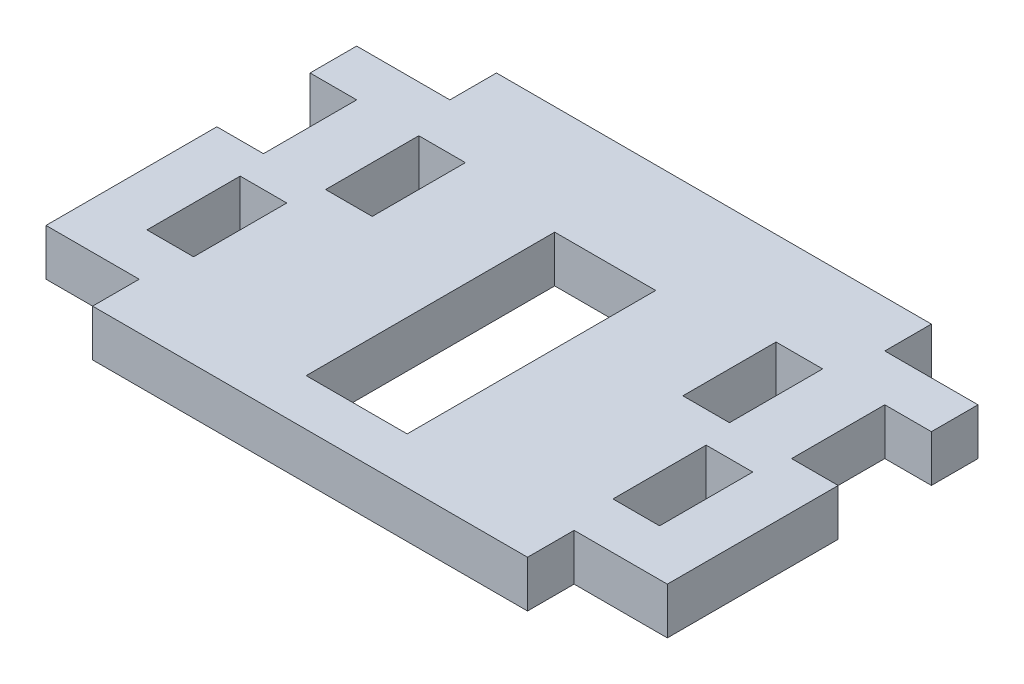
ISO-10303-21;
HEADER;
FILE_DESCRIPTION(('STEP AP214'),'2;1');
FILE_NAME('part.step','',(''),(''),'','','');
FILE_SCHEMA(('AUTOMOTIVE_DESIGN { 1 0 10303 214 1 1 1 1 }'));
ENDSEC;
DATA;
#1=APPLICATION_CONTEXT('core data for automotive mechanical design processes');
#2=APPLICATION_PROTOCOL_DEFINITION('international standard','automotive_design',2000,#1);
#3=PRODUCT_CONTEXT('',#1,'mechanical');
#4=PRODUCT('Part','Part','',(#3));
#5=PRODUCT_RELATED_PRODUCT_CATEGORY('part','',(#4));
#6=PRODUCT_DEFINITION_FORMATION('','',#4);
#7=PRODUCT_DEFINITION_CONTEXT('part definition',#1,'design');
#8=PRODUCT_DEFINITION('design','',#6,#7);
#9=PRODUCT_DEFINITION_SHAPE('','',#8);
#10=(LENGTH_UNIT() NAMED_UNIT(*) SI_UNIT(.MILLI.,.METRE.));
#11=(NAMED_UNIT(*) PLANE_ANGLE_UNIT() SI_UNIT($,.RADIAN.));
#12=(NAMED_UNIT(*) SI_UNIT($,.STERADIAN.) SOLID_ANGLE_UNIT());
#13=UNCERTAINTY_MEASURE_WITH_UNIT(LENGTH_MEASURE(1.E-05),#10,'distance_accuracy_value','');
#14=(GEOMETRIC_REPRESENTATION_CONTEXT(3) GLOBAL_UNCERTAINTY_ASSIGNED_CONTEXT((#13)) GLOBAL_UNIT_ASSIGNED_CONTEXT((#10,
#11,#12)) REPRESENTATION_CONTEXT('',''));
#15=CARTESIAN_POINT('',(0.,0.,0.));
#16=DIRECTION('',(0.,0.,1.));
#17=DIRECTION('',(1.,0.,0.));
#18=AXIS2_PLACEMENT_3D('',#15,#16,#17);
#19=CARTESIAN_POINT('',(20.,3.,10.));
#20=DIRECTION('',(0.,1.,0.));
#21=DIRECTION('',(0.,0.,1.));
#22=AXIS2_PLACEMENT_3D('',#19,#20,#21);
#23=PLANE('',#22);
#24=DIRECTION('',(-1.,0.,0.));
#25=VECTOR('',#24,1.);
#26=CARTESIAN_POINT('',(13.,3.,-7.));
#27=LINE('',#26,#25);
#28=CARTESIAN_POINT('',(13.,3.,-7.));
#29=VERTEX_POINT('',#28);
#30=CARTESIAN_POINT('',(10.,3.,-7.));
#31=VERTEX_POINT('',#30);
#32=EDGE_CURVE('E329',#29,#31,#27,.T.);
#33=ORIENTED_EDGE('',*,*,#32,.F.);
#34=DIRECTION('',(0.,0.,-1.));
#35=VECTOR('',#34,1.);
#36=CARTESIAN_POINT('',(13.,3.,-7.));
#37=LINE('',#36,#35);
#38=CARTESIAN_POINT('',(13.,3.,-0.999999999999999));
#39=VERTEX_POINT('',#38);
#40=EDGE_CURVE('E327',#39,#29,#37,.T.);
#41=ORIENTED_EDGE('',*,*,#40,.F.);
#42=DIRECTION('',(1.,0.,0.));
#43=VECTOR('',#42,1.);
#44=CARTESIAN_POINT('',(13.,3.,-0.999999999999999));
#45=LINE('',#44,#43);
#46=CARTESIAN_POINT('',(10.,3.,-0.999999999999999));
#47=VERTEX_POINT('',#46);
#48=EDGE_CURVE('E335',#47,#39,#45,.T.);
#49=ORIENTED_EDGE('',*,*,#48,.F.);
#50=DIRECTION('',(0.,0.,1.));
#51=VECTOR('',#50,1.);
#52=CARTESIAN_POINT('',(10.,3.,-7.));
#53=LINE('',#52,#51);
#54=EDGE_CURVE('E332',#31,#47,#53,.T.);
#55=ORIENTED_EDGE('',*,*,#54,.F.);
#56=EDGE_LOOP('',(#33,#41,#49,#55));
#57=FACE_BOUND('',#56,.T.);
#58=DIRECTION('',(1.,0.,0.));
#59=VECTOR('',#58,1.);
#60=CARTESIAN_POINT('',(-16.5,3.,7.));
#61=LINE('',#60,#59);
#62=CARTESIAN_POINT('',(-16.5,3.,7.));
#63=VERTEX_POINT('',#62);
#64=CARTESIAN_POINT('',(-13.5,3.,7.));
#65=VERTEX_POINT('',#64);
#66=EDGE_CURVE('E384',#63,#65,#61,.T.);
#67=ORIENTED_EDGE('',*,*,#66,.F.);
#68=DIRECTION('',(0.,0.,1.));
#69=VECTOR('',#68,1.);
#70=CARTESIAN_POINT('',(-16.5,3.,1.));
#71=LINE('',#70,#69);
#72=CARTESIAN_POINT('',(-16.5,3.,1.));
#73=VERTEX_POINT('',#72);
#74=EDGE_CURVE('E382',#73,#63,#71,.T.);
#75=ORIENTED_EDGE('',*,*,#74,.F.);
#76=DIRECTION('',(-1.,0.,0.));
#77=VECTOR('',#76,1.);
#78=CARTESIAN_POINT('',(-16.5,3.,1.));
#79=LINE('',#78,#77);
#80=CARTESIAN_POINT('',(-13.5,3.,1.));
#81=VERTEX_POINT('',#80);
#82=EDGE_CURVE('E390',#81,#73,#79,.T.);
#83=ORIENTED_EDGE('',*,*,#82,.F.);
#84=DIRECTION('',(0.,0.,-1.));
#85=VECTOR('',#84,1.);
#86=CARTESIAN_POINT('',(-13.5,3.,1.));
#87=LINE('',#86,#85);
#88=EDGE_CURVE('E387',#65,#81,#87,.T.);
#89=ORIENTED_EDGE('',*,*,#88,.F.);
#90=EDGE_LOOP('',(#67,#75,#83,#89));
#91=FACE_BOUND('',#90,.T.);
#92=DIRECTION('',(-1.,0.,0.));
#93=VECTOR('',#92,1.);
#94=CARTESIAN_POINT('',(-3.25,3.,-6.));
#95=LINE('',#94,#93);
#96=CARTESIAN_POINT('',(3.25,3.,-6.));
#97=VERTEX_POINT('',#96);
#98=CARTESIAN_POINT('',(-3.25,3.,-6.));
#99=VERTEX_POINT('',#98);
#100=EDGE_CURVE('E470',#97,#99,#95,.T.);
#101=ORIENTED_EDGE('',*,*,#100,.F.);
#102=DIRECTION('',(0.,0.,-1.));
#103=VECTOR('',#102,1.);
#104=CARTESIAN_POINT('',(3.25,3.,6.));
#105=LINE('',#104,#103);
#106=CARTESIAN_POINT('',(3.25,3.,10.));
#107=VERTEX_POINT('',#106);
#108=EDGE_CURVE('E468',#107,#97,#105,.T.);
#109=ORIENTED_EDGE('',*,*,#108,.F.);
#110=DIRECTION('',(1.,0.,0.));
#111=VECTOR('',#110,1.);
#112=CARTESIAN_POINT('',(-3.25,3.,10.));
#113=LINE('',#112,#111);
#114=CARTESIAN_POINT('',(-3.25,3.,10.));
#115=VERTEX_POINT('',#114);
#116=EDGE_CURVE('E476',#115,#107,#113,.T.);
#117=ORIENTED_EDGE('',*,*,#116,.F.);
#118=DIRECTION('',(0.,0.,1.));
#119=VECTOR('',#118,1.);
#120=CARTESIAN_POINT('',(-3.25,3.,-6.));
#121=LINE('',#120,#119);
#122=EDGE_CURVE('E473',#99,#115,#121,.T.);
#123=ORIENTED_EDGE('',*,*,#122,.F.);
#124=EDGE_LOOP('',(#101,#109,#117,#123));
#125=FACE_BOUND('',#124,.T.);
#126=DIRECTION('',(1.,0.,0.));
#127=VECTOR('',#126,1.);
#128=CARTESIAN_POINT('',(-13.,3.,-0.999999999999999));
#129=LINE('',#128,#127);
#130=CARTESIAN_POINT('',(-13.,3.,-0.999999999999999));
#131=VERTEX_POINT('',#130);
#132=CARTESIAN_POINT('',(-10.,3.,-0.999999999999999));
#133=VERTEX_POINT('',#132);
#134=EDGE_CURVE('E415',#131,#133,#129,.T.);
#135=ORIENTED_EDGE('',*,*,#134,.F.);
#136=DIRECTION('',(0.,0.,1.));
#137=VECTOR('',#136,1.);
#138=CARTESIAN_POINT('',(-13.,3.,-7.));
#139=LINE('',#138,#137);
#140=CARTESIAN_POINT('',(-13.,3.,-7.));
#141=VERTEX_POINT('',#140);
#142=EDGE_CURVE('E413',#141,#131,#139,.T.);
#143=ORIENTED_EDGE('',*,*,#142,.F.);
#144=DIRECTION('',(-1.,0.,0.));
#145=VECTOR('',#144,1.);
#146=CARTESIAN_POINT('',(-13.,3.,-7.));
#147=LINE('',#146,#145);
#148=CARTESIAN_POINT('',(-10.,3.,-7.));
#149=VERTEX_POINT('',#148);
#150=EDGE_CURVE('E421',#149,#141,#147,.T.);
#151=ORIENTED_EDGE('',*,*,#150,.F.);
#152=DIRECTION('',(0.,0.,-1.));
#153=VECTOR('',#152,1.);
#154=CARTESIAN_POINT('',(-10.,3.,-7.));
#155=LINE('',#154,#153);
#156=EDGE_CURVE('E418',#133,#149,#155,.T.);
#157=ORIENTED_EDGE('',*,*,#156,.F.);
#158=EDGE_LOOP('',(#135,#143,#151,#157));
#159=FACE_BOUND('',#158,.T.);
#160=DIRECTION('',(0.,0.,-1.));
#161=VECTOR('',#160,1.);
#162=CARTESIAN_POINT('',(20.,3.,-10.));
#163=LINE('',#162,#161);
#164=CARTESIAN_POINT('',(20.,3.,10.));
#165=VERTEX_POINT('',#164);
#166=CARTESIAN_POINT('',(20.,3.,-0.999999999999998));
#167=VERTEX_POINT('',#166);
#168=EDGE_CURVE('E600',#165,#167,#163,.T.);
#169=ORIENTED_EDGE('',*,*,#168,.T.);
#170=DIRECTION('',(1.,0.,0.));
#171=VECTOR('',#170,1.);
#172=CARTESIAN_POINT('',(20.,3.,-0.999999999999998));
#173=LINE('',#172,#171);
#174=CARTESIAN_POINT('',(17.,3.,-0.999999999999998));
#175=VERTEX_POINT('',#174);
#176=EDGE_CURVE('E358',#175,#167,#173,.T.);
#177=ORIENTED_EDGE('',*,*,#176,.F.);
#178=DIRECTION('',(0.,0.,1.));
#179=VECTOR('',#178,1.);
#180=CARTESIAN_POINT('',(17.,3.,-7.));
#181=LINE('',#180,#179);
#182=CARTESIAN_POINT('',(17.,3.,-7.));
#183=VERTEX_POINT('',#182);
#184=EDGE_CURVE('E363',#183,#175,#181,.T.);
#185=ORIENTED_EDGE('',*,*,#184,.F.);
#186=DIRECTION('',(-1.,0.,0.));
#187=VECTOR('',#186,1.);
#188=CARTESIAN_POINT('',(20.,3.,-7.));
#189=LINE('',#188,#187);
#190=CARTESIAN_POINT('',(20.,3.,-7.));
#191=VERTEX_POINT('',#190);
#192=EDGE_CURVE('E360',#191,#183,#189,.T.);
#193=ORIENTED_EDGE('',*,*,#192,.F.);
#194=CARTESIAN_POINT('',(20.,3.,-10.));
#195=VERTEX_POINT('',#194);
#196=EDGE_CURVE('E617',#191,#195,#163,.T.);
#197=ORIENTED_EDGE('',*,*,#196,.T.);
#198=DIRECTION('',(-1.,0.,0.));
#199=VECTOR('',#198,1.);
#200=CARTESIAN_POINT('',(-20.,3.,-10.));
#201=LINE('',#200,#199);
#202=CARTESIAN_POINT('',(14.,3.,-10.));
#203=VERTEX_POINT('',#202);
#204=EDGE_CURVE('E562',#195,#203,#201,.T.);
#205=ORIENTED_EDGE('',*,*,#204,.T.);
#206=DIRECTION('',(0.,0.,-1.));
#207=VECTOR('',#206,1.);
#208=CARTESIAN_POINT('',(14.,3.,-13.));
#209=LINE('',#208,#207);
#210=CARTESIAN_POINT('',(14.,3.,-13.));
#211=VERTEX_POINT('',#210);
#212=EDGE_CURVE('E706',#203,#211,#209,.T.);
#213=ORIENTED_EDGE('',*,*,#212,.T.);
#214=DIRECTION('',(-1.,0.,0.));
#215=VECTOR('',#214,1.);
#216=CARTESIAN_POINT('',(14.,3.,-13.));
#217=LINE('',#216,#215);
#218=CARTESIAN_POINT('',(-14.,3.,-13.));
#219=VERTEX_POINT('',#218);
#220=EDGE_CURVE('E702',#211,#219,#217,.T.);
#221=ORIENTED_EDGE('',*,*,#220,.T.);
#222=DIRECTION('',(0.,0.,1.));
#223=VECTOR('',#222,1.);
#224=CARTESIAN_POINT('',(-14.,3.,-13.));
#225=LINE('',#224,#223);
#226=CARTESIAN_POINT('',(-14.,3.,-10.));
#227=VERTEX_POINT('',#226);
#228=EDGE_CURVE('E611',#219,#227,#225,.T.);
#229=ORIENTED_EDGE('',*,*,#228,.T.);
#230=CARTESIAN_POINT('',(-20.,3.,-10.));
#231=VERTEX_POINT('',#230);
#232=EDGE_CURVE('E598',#227,#231,#201,.T.);
#233=ORIENTED_EDGE('',*,*,#232,.T.);
#234=DIRECTION('',(0.,0.,1.));
#235=VECTOR('',#234,1.);
#236=CARTESIAN_POINT('',(-20.,3.,-10.));
#237=LINE('',#236,#235);
#238=CARTESIAN_POINT('',(-20.,3.,-7.));
#239=VERTEX_POINT('',#238);
#240=EDGE_CURVE('E555',#231,#239,#237,.T.);
#241=ORIENTED_EDGE('',*,*,#240,.T.);
#242=DIRECTION('',(-1.,0.,0.));
#243=VECTOR('',#242,1.);
#244=CARTESIAN_POINT('',(-20.,3.,-7.));
#245=LINE('',#244,#243);
#246=CARTESIAN_POINT('',(-17.,3.,-7.));
#247=VERTEX_POINT('',#246);
#248=EDGE_CURVE('E449',#247,#239,#245,.T.);
#249=ORIENTED_EDGE('',*,*,#248,.F.);
#250=DIRECTION('',(0.,0.,-1.));
#251=VECTOR('',#250,1.);
#252=CARTESIAN_POINT('',(-17.,3.,-7.));
#253=LINE('',#252,#251);
#254=CARTESIAN_POINT('',(-17.,3.,-0.999999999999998));
#255=VERTEX_POINT('',#254);
#256=EDGE_CURVE('E446',#255,#247,#253,.T.);
#257=ORIENTED_EDGE('',*,*,#256,.F.);
#258=DIRECTION('',(1.,0.,0.));
#259=VECTOR('',#258,1.);
#260=CARTESIAN_POINT('',(-20.,3.,-0.999999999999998));
#261=LINE('',#260,#259);
#262=CARTESIAN_POINT('',(-20.,3.,-0.999999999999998));
#263=VERTEX_POINT('',#262);
#264=EDGE_CURVE('E444',#263,#255,#261,.T.);
#265=ORIENTED_EDGE('',*,*,#264,.F.);
#266=CARTESIAN_POINT('',(-20.,3.,10.));
#267=VERTEX_POINT('',#266);
#268=EDGE_CURVE('E558',#263,#267,#237,.T.);
#269=ORIENTED_EDGE('',*,*,#268,.T.);
#270=DIRECTION('',(1.,0.,0.));
#271=VECTOR('',#270,1.);
#272=CARTESIAN_POINT('',(-20.,3.,10.));
#273=LINE('',#272,#271);
#274=CARTESIAN_POINT('',(-14.,3.,10.));
#275=VERTEX_POINT('',#274);
#276=EDGE_CURVE('E554',#267,#275,#273,.T.);
#277=ORIENTED_EDGE('',*,*,#276,.T.);
#278=DIRECTION('',(0.,0.,1.));
#279=VECTOR('',#278,1.);
#280=CARTESIAN_POINT('',(-14.,3.,13.));
#281=LINE('',#280,#279);
#282=CARTESIAN_POINT('',(-14.,3.,13.));
#283=VERTEX_POINT('',#282);
#284=EDGE_CURVE('E501',#275,#283,#281,.T.);
#285=ORIENTED_EDGE('',*,*,#284,.T.);
#286=DIRECTION('',(1.,0.,0.));
#287=VECTOR('',#286,1.);
#288=CARTESIAN_POINT('',(14.,3.,13.));
#289=LINE('',#288,#287);
#290=CARTESIAN_POINT('',(14.,3.,13.));
#291=VERTEX_POINT('',#290);
#292=EDGE_CURVE('E498',#283,#291,#289,.T.);
#293=ORIENTED_EDGE('',*,*,#292,.T.);
#294=DIRECTION('',(0.,0.,-1.));
#295=VECTOR('',#294,1.);
#296=CARTESIAN_POINT('',(14.,3.,13.));
#297=LINE('',#296,#295);
#298=CARTESIAN_POINT('',(14.,3.,10.));
#299=VERTEX_POINT('',#298);
#300=EDGE_CURVE('E504',#291,#299,#297,.T.);
#301=ORIENTED_EDGE('',*,*,#300,.T.);
#302=EDGE_CURVE('E534',#299,#165,#273,.T.);
#303=ORIENTED_EDGE('',*,*,#302,.T.);
#304=EDGE_LOOP('',(#169,#177,#185,#193,#197,#205,#213,#221,#229,#233,#241,#249,#257,#265,#269,
#277,#285,#293,#301,#303));
#305=FACE_BOUND('',#304,.T.);
#306=DIRECTION('',(0.,0.,1.));
#307=VECTOR('',#306,1.);
#308=CARTESIAN_POINT('',(13.5,3.,1.));
#309=LINE('',#308,#307);
#310=CARTESIAN_POINT('',(13.5,3.,1.));
#311=VERTEX_POINT('',#310);
#312=CARTESIAN_POINT('',(13.5,3.,7.));
#313=VERTEX_POINT('',#312);
#314=EDGE_CURVE('E299',#311,#313,#309,.T.);
#315=ORIENTED_EDGE('',*,*,#314,.F.);
#316=DIRECTION('',(-1.,0.,0.));
#317=VECTOR('',#316,1.);
#318=CARTESIAN_POINT('',(16.5,3.,1.));
#319=LINE('',#318,#317);
#320=CARTESIAN_POINT('',(16.5,3.,1.));
#321=VERTEX_POINT('',#320);
#322=EDGE_CURVE('E291',#321,#311,#319,.T.);
#323=ORIENTED_EDGE('',*,*,#322,.F.);
#324=DIRECTION('',(0.,0.,-1.));
#325=VECTOR('',#324,1.);
#326=CARTESIAN_POINT('',(16.5,3.,1.));
#327=LINE('',#326,#325);
#328=CARTESIAN_POINT('',(16.5,3.,7.));
#329=VERTEX_POINT('',#328);
#330=EDGE_CURVE('E313',#329,#321,#327,.T.);
#331=ORIENTED_EDGE('',*,*,#330,.F.);
#332=DIRECTION('',(1.,0.,0.));
#333=VECTOR('',#332,1.);
#334=CARTESIAN_POINT('',(16.5,3.,7.));
#335=LINE('',#334,#333);
#336=EDGE_CURVE('E311',#313,#329,#335,.T.);
#337=ORIENTED_EDGE('',*,*,#336,.F.);
#338=EDGE_LOOP('',(#315,#323,#331,#337));
#339=FACE_BOUND('',#338,.T.);
#340=ADVANCED_FACE('F32',(#57,#91,#125,#159,#305,#339),#23,.T.);
#341=CARTESIAN_POINT('',(20.,0.,10.));
#342=DIRECTION('',(0.,1.,0.));
#343=DIRECTION('',(0.,0.,1.));
#344=AXIS2_PLACEMENT_3D('',#341,#342,#343);
#345=PLANE('',#344);
#346=DIRECTION('',(0.,0.,-1.));
#347=VECTOR('',#346,1.);
#348=CARTESIAN_POINT('',(13.,0.,-7.));
#349=LINE('',#348,#347);
#350=CARTESIAN_POINT('',(13.,0.,-0.999999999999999));
#351=VERTEX_POINT('',#350);
#352=CARTESIAN_POINT('',(13.,0.,-7.));
#353=VERTEX_POINT('',#352);
#354=EDGE_CURVE('E307',#351,#353,#349,.T.);
#355=ORIENTED_EDGE('',*,*,#354,.T.);
#356=DIRECTION('',(-1.,0.,0.));
#357=VECTOR('',#356,1.);
#358=CARTESIAN_POINT('',(13.,0.,-7.));
#359=LINE('',#358,#357);
#360=CARTESIAN_POINT('',(10.,0.,-7.));
#361=VERTEX_POINT('',#360);
#362=EDGE_CURVE('E340',#353,#361,#359,.T.);
#363=ORIENTED_EDGE('',*,*,#362,.T.);
#364=DIRECTION('',(0.,0.,1.));
#365=VECTOR('',#364,1.);
#366=CARTESIAN_POINT('',(10.,0.,-7.));
#367=LINE('',#366,#365);
#368=CARTESIAN_POINT('',(10.,0.,-0.999999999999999));
#369=VERTEX_POINT('',#368);
#370=EDGE_CURVE('E343',#361,#369,#367,.T.);
#371=ORIENTED_EDGE('',*,*,#370,.T.);
#372=DIRECTION('',(1.,0.,0.));
#373=VECTOR('',#372,1.);
#374=CARTESIAN_POINT('',(13.,0.,-0.999999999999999));
#375=LINE('',#374,#373);
#376=EDGE_CURVE('E330',#369,#351,#375,.T.);
#377=ORIENTED_EDGE('',*,*,#376,.T.);
#378=EDGE_LOOP('',(#355,#363,#371,#377));
#379=FACE_BOUND('',#378,.T.);
#380=DIRECTION('',(0.,0.,1.));
#381=VECTOR('',#380,1.);
#382=CARTESIAN_POINT('',(-16.5,0.,1.));
#383=LINE('',#382,#381);
#384=CARTESIAN_POINT('',(-16.5,0.,1.));
#385=VERTEX_POINT('',#384);
#386=CARTESIAN_POINT('',(-16.5,0.,7.));
#387=VERTEX_POINT('',#386);
#388=EDGE_CURVE('E381',#385,#387,#383,.T.);
#389=ORIENTED_EDGE('',*,*,#388,.T.);
#390=DIRECTION('',(1.,0.,0.));
#391=VECTOR('',#390,1.);
#392=CARTESIAN_POINT('',(-16.5,0.,7.));
#393=LINE('',#392,#391);
#394=CARTESIAN_POINT('',(-13.5,0.,7.));
#395=VERTEX_POINT('',#394);
#396=EDGE_CURVE('E395',#387,#395,#393,.T.);
#397=ORIENTED_EDGE('',*,*,#396,.T.);
#398=DIRECTION('',(0.,0.,-1.));
#399=VECTOR('',#398,1.);
#400=CARTESIAN_POINT('',(-13.5,0.,1.));
#401=LINE('',#400,#399);
#402=CARTESIAN_POINT('',(-13.5,0.,1.));
#403=VERTEX_POINT('',#402);
#404=EDGE_CURVE('E398',#395,#403,#401,.T.);
#405=ORIENTED_EDGE('',*,*,#404,.T.);
#406=DIRECTION('',(-1.,0.,0.));
#407=VECTOR('',#406,1.);
#408=CARTESIAN_POINT('',(-16.5,0.,1.));
#409=LINE('',#408,#407);
#410=EDGE_CURVE('E385',#403,#385,#409,.T.);
#411=ORIENTED_EDGE('',*,*,#410,.T.);
#412=EDGE_LOOP('',(#389,#397,#405,#411));
#413=FACE_BOUND('',#412,.T.);
#414=DIRECTION('',(0.,0.,-1.));
#415=VECTOR('',#414,1.);
#416=CARTESIAN_POINT('',(3.25,0.,-6.));
#417=LINE('',#416,#415);
#418=CARTESIAN_POINT('',(3.25,0.,10.));
#419=VERTEX_POINT('',#418);
#420=CARTESIAN_POINT('',(3.25,0.,-6.));
#421=VERTEX_POINT('',#420);
#422=EDGE_CURVE('E467',#419,#421,#417,.T.);
#423=ORIENTED_EDGE('',*,*,#422,.T.);
#424=DIRECTION('',(-1.,0.,0.));
#425=VECTOR('',#424,1.);
#426=CARTESIAN_POINT('',(-3.25,0.,-6.));
#427=LINE('',#426,#425);
#428=CARTESIAN_POINT('',(-3.25,0.,-6.));
#429=VERTEX_POINT('',#428);
#430=EDGE_CURVE('E481',#421,#429,#427,.T.);
#431=ORIENTED_EDGE('',*,*,#430,.T.);
#432=DIRECTION('',(0.,0.,1.));
#433=VECTOR('',#432,1.);
#434=CARTESIAN_POINT('',(-3.25,0.,6.));
#435=LINE('',#434,#433);
#436=CARTESIAN_POINT('',(-3.25,0.,10.));
#437=VERTEX_POINT('',#436);
#438=EDGE_CURVE('E484',#429,#437,#435,.T.);
#439=ORIENTED_EDGE('',*,*,#438,.T.);
#440=DIRECTION('',(1.,0.,0.));
#441=VECTOR('',#440,1.);
#442=CARTESIAN_POINT('',(-3.25,0.,10.));
#443=LINE('',#442,#441);
#444=EDGE_CURVE('E471',#437,#419,#443,.T.);
#445=ORIENTED_EDGE('',*,*,#444,.T.);
#446=EDGE_LOOP('',(#423,#431,#439,#445));
#447=FACE_BOUND('',#446,.T.);
#448=DIRECTION('',(0.,0.,1.));
#449=VECTOR('',#448,1.);
#450=CARTESIAN_POINT('',(-13.,0.,-7.));
#451=LINE('',#450,#449);
#452=CARTESIAN_POINT('',(-13.,0.,-7.));
#453=VERTEX_POINT('',#452);
#454=CARTESIAN_POINT('',(-13.,0.,-0.999999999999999));
#455=VERTEX_POINT('',#454);
#456=EDGE_CURVE('E412',#453,#455,#451,.T.);
#457=ORIENTED_EDGE('',*,*,#456,.T.);
#458=DIRECTION('',(1.,0.,0.));
#459=VECTOR('',#458,1.);
#460=CARTESIAN_POINT('',(-13.,0.,-0.999999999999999));
#461=LINE('',#460,#459);
#462=CARTESIAN_POINT('',(-10.,0.,-0.999999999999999));
#463=VERTEX_POINT('',#462);
#464=EDGE_CURVE('E426',#455,#463,#461,.T.);
#465=ORIENTED_EDGE('',*,*,#464,.T.);
#466=DIRECTION('',(0.,0.,-1.));
#467=VECTOR('',#466,1.);
#468=CARTESIAN_POINT('',(-10.,0.,-7.));
#469=LINE('',#468,#467);
#470=CARTESIAN_POINT('',(-10.,0.,-7.));
#471=VERTEX_POINT('',#470);
#472=EDGE_CURVE('E429',#463,#471,#469,.T.);
#473=ORIENTED_EDGE('',*,*,#472,.T.);
#474=DIRECTION('',(-1.,0.,0.));
#475=VECTOR('',#474,1.);
#476=CARTESIAN_POINT('',(-13.,0.,-7.));
#477=LINE('',#476,#475);
#478=EDGE_CURVE('E416',#471,#453,#477,.T.);
#479=ORIENTED_EDGE('',*,*,#478,.T.);
#480=EDGE_LOOP('',(#457,#465,#473,#479));
#481=FACE_BOUND('',#480,.T.);
#482=DIRECTION('',(1.,0.,0.));
#483=VECTOR('',#482,1.);
#484=CARTESIAN_POINT('',(20.,0.,-0.999999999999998));
#485=LINE('',#484,#483);
#486=CARTESIAN_POINT('',(17.,0.,-0.999999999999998));
#487=VERTEX_POINT('',#486);
#488=CARTESIAN_POINT('',(20.,0.,-0.999999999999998));
#489=VERTEX_POINT('',#488);
#490=EDGE_CURVE('E357',#487,#489,#485,.T.);
#491=ORIENTED_EDGE('',*,*,#490,.T.);
#492=DIRECTION('',(0.,0.,-1.));
#493=VECTOR('',#492,1.);
#494=CARTESIAN_POINT('',(20.,0.,-10.));
#495=LINE('',#494,#493);
#496=CARTESIAN_POINT('',(20.,0.,10.));
#497=VERTEX_POINT('',#496);
#498=EDGE_CURVE('E568',#497,#489,#495,.T.);
#499=ORIENTED_EDGE('',*,*,#498,.F.);
#500=DIRECTION('',(1.,0.,0.));
#501=VECTOR('',#500,1.);
#502=CARTESIAN_POINT('',(-20.,0.,10.));
#503=LINE('',#502,#501);
#504=CARTESIAN_POINT('',(14.,0.,10.));
#505=VERTEX_POINT('',#504);
#506=EDGE_CURVE('E572',#505,#497,#503,.T.);
#507=ORIENTED_EDGE('',*,*,#506,.F.);
#508=DIRECTION('',(0.,0.,-1.));
#509=VECTOR('',#508,1.);
#510=CARTESIAN_POINT('',(14.,0.,13.));
#511=LINE('',#510,#509);
#512=CARTESIAN_POINT('',(14.,0.,13.));
#513=VERTEX_POINT('',#512);
#514=EDGE_CURVE('E497',#513,#505,#511,.T.);
#515=ORIENTED_EDGE('',*,*,#514,.F.);
#516=DIRECTION('',(1.,0.,0.));
#517=VECTOR('',#516,1.);
#518=CARTESIAN_POINT('',(14.,0.,13.));
#519=LINE('',#518,#517);
#520=CARTESIAN_POINT('',(-14.,0.,13.));
#521=VERTEX_POINT('',#520);
#522=EDGE_CURVE('E502',#521,#513,#519,.T.);
#523=ORIENTED_EDGE('',*,*,#522,.F.);
#524=DIRECTION('',(0.,0.,1.));
#525=VECTOR('',#524,1.);
#526=CARTESIAN_POINT('',(-14.,0.,13.));
#527=LINE('',#526,#525);
#528=CARTESIAN_POINT('',(-14.,0.,10.));
#529=VERTEX_POINT('',#528);
#530=EDGE_CURVE('E505',#529,#521,#527,.T.);
#531=ORIENTED_EDGE('',*,*,#530,.F.);
#532=CARTESIAN_POINT('',(-20.,0.,10.));
#533=VERTEX_POINT('',#532);
#534=EDGE_CURVE('E575',#533,#529,#503,.T.);
#535=ORIENTED_EDGE('',*,*,#534,.F.);
#536=DIRECTION('',(0.,0.,1.));
#537=VECTOR('',#536,1.);
#538=CARTESIAN_POINT('',(-20.,0.,-10.));
#539=LINE('',#538,#537);
#540=CARTESIAN_POINT('',(-20.,0.,-0.999999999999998));
#541=VERTEX_POINT('',#540);
#542=EDGE_CURVE('E591',#541,#533,#539,.T.);
#543=ORIENTED_EDGE('',*,*,#542,.F.);
#544=DIRECTION('',(1.,0.,0.));
#545=VECTOR('',#544,1.);
#546=CARTESIAN_POINT('',(-20.,0.,-0.999999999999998));
#547=LINE('',#546,#545);
#548=CARTESIAN_POINT('',(-17.,0.,-0.999999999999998));
#549=VERTEX_POINT('',#548);
#550=EDGE_CURVE('E443',#541,#549,#547,.T.);
#551=ORIENTED_EDGE('',*,*,#550,.T.);
#552=DIRECTION('',(0.,0.,-1.));
#553=VECTOR('',#552,1.);
#554=CARTESIAN_POINT('',(-17.,0.,-7.));
#555=LINE('',#554,#553);
#556=CARTESIAN_POINT('',(-17.,0.,-7.));
#557=VERTEX_POINT('',#556);
#558=EDGE_CURVE('E454',#549,#557,#555,.T.);
#559=ORIENTED_EDGE('',*,*,#558,.T.);
#560=DIRECTION('',(-1.,0.,0.));
#561=VECTOR('',#560,1.);
#562=CARTESIAN_POINT('',(-20.,0.,-7.));
#563=LINE('',#562,#561);
#564=CARTESIAN_POINT('',(-20.,0.,-7.));
#565=VERTEX_POINT('',#564);
#566=EDGE_CURVE('E447',#557,#565,#563,.T.);
#567=ORIENTED_EDGE('',*,*,#566,.T.);
#568=CARTESIAN_POINT('',(-20.,0.,-10.));
#569=VERTEX_POINT('',#568);
#570=EDGE_CURVE('E576',#569,#565,#539,.T.);
#571=ORIENTED_EDGE('',*,*,#570,.F.);
#572=DIRECTION('',(-1.,0.,0.));
#573=VECTOR('',#572,1.);
#574=CARTESIAN_POINT('',(-20.,0.,-10.));
#575=LINE('',#574,#573);
#576=CARTESIAN_POINT('',(-14.,0.,-10.));
#577=VERTEX_POINT('',#576);
#578=EDGE_CURVE('E592',#577,#569,#575,.T.);
#579=ORIENTED_EDGE('',*,*,#578,.F.);
#580=DIRECTION('',(0.,0.,1.));
#581=VECTOR('',#580,1.);
#582=CARTESIAN_POINT('',(-14.,0.,-13.));
#583=LINE('',#582,#581);
#584=CARTESIAN_POINT('',(-14.,0.,-13.));
#585=VERTEX_POINT('',#584);
#586=EDGE_CURVE('E539',#585,#577,#583,.T.);
#587=ORIENTED_EDGE('',*,*,#586,.F.);
#588=DIRECTION('',(-1.,0.,0.));
#589=VECTOR('',#588,1.);
#590=CARTESIAN_POINT('',(14.,0.,-13.));
#591=LINE('',#590,#589);
#592=CARTESIAN_POINT('',(14.,0.,-13.));
#593=VERTEX_POINT('',#592);
#594=EDGE_CURVE('E707',#593,#585,#591,.T.);
#595=ORIENTED_EDGE('',*,*,#594,.F.);
#596=DIRECTION('',(0.,0.,-1.));
#597=VECTOR('',#596,1.);
#598=CARTESIAN_POINT('',(14.,0.,-13.));
#599=LINE('',#598,#597);
#600=CARTESIAN_POINT('',(14.,0.,-10.));
#601=VERTEX_POINT('',#600);
#602=EDGE_CURVE('E602',#601,#593,#599,.T.);
#603=ORIENTED_EDGE('',*,*,#602,.F.);
#604=CARTESIAN_POINT('',(20.,0.,-10.));
#605=VERTEX_POINT('',#604);
#606=EDGE_CURVE('E588',#605,#601,#575,.T.);
#607=ORIENTED_EDGE('',*,*,#606,.F.);
#608=CARTESIAN_POINT('',(20.,0.,-7.));
#609=VERTEX_POINT('',#608);
#610=EDGE_CURVE('E609',#609,#605,#495,.T.);
#611=ORIENTED_EDGE('',*,*,#610,.F.);
#612=DIRECTION('',(-1.,0.,0.));
#613=VECTOR('',#612,1.);
#614=CARTESIAN_POINT('',(20.,0.,-7.));
#615=LINE('',#614,#613);
#616=CARTESIAN_POINT('',(17.,0.,-7.));
#617=VERTEX_POINT('',#616);
#618=EDGE_CURVE('E368',#609,#617,#615,.T.);
#619=ORIENTED_EDGE('',*,*,#618,.T.);
#620=DIRECTION('',(0.,0.,1.));
#621=VECTOR('',#620,1.);
#622=CARTESIAN_POINT('',(17.,0.,-7.));
#623=LINE('',#622,#621);
#624=EDGE_CURVE('E361',#617,#487,#623,.T.);
#625=ORIENTED_EDGE('',*,*,#624,.T.);
#626=EDGE_LOOP('',(#491,#499,#507,#515,#523,#531,#535,#543,#551,#559,#567,#571,#579,#587,#595,
#603,#607,#611,#619,#625));
#627=FACE_BOUND('',#626,.T.);
#628=DIRECTION('',(-1.,0.,0.));
#629=VECTOR('',#628,1.);
#630=CARTESIAN_POINT('',(16.5,0.,1.));
#631=LINE('',#630,#629);
#632=CARTESIAN_POINT('',(16.5,0.,1.));
#633=VERTEX_POINT('',#632);
#634=CARTESIAN_POINT('',(13.5,0.,1.));
#635=VERTEX_POINT('',#634);
#636=EDGE_CURVE('E57',#633,#635,#631,.T.);
#637=ORIENTED_EDGE('',*,*,#636,.T.);
#638=DIRECTION('',(0.,0.,1.));
#639=VECTOR('',#638,1.);
#640=CARTESIAN_POINT('',(13.5,0.,1.));
#641=LINE('',#640,#639);
#642=CARTESIAN_POINT('',(13.5,0.,7.));
#643=VERTEX_POINT('',#642);
#644=EDGE_CURVE('E306',#635,#643,#641,.T.);
#645=ORIENTED_EDGE('',*,*,#644,.T.);
#646=DIRECTION('',(1.,0.,0.));
#647=VECTOR('',#646,1.);
#648=CARTESIAN_POINT('',(16.5,0.,7.));
#649=LINE('',#648,#647);
#650=CARTESIAN_POINT('',(16.5,0.,7.));
#651=VERTEX_POINT('',#650);
#652=EDGE_CURVE('E319',#643,#651,#649,.T.);
#653=ORIENTED_EDGE('',*,*,#652,.T.);
#654=DIRECTION('',(0.,0.,-1.));
#655=VECTOR('',#654,1.);
#656=CARTESIAN_POINT('',(16.5,0.,1.));
#657=LINE('',#656,#655);
#658=EDGE_CURVE('E300',#651,#633,#657,.T.);
#659=ORIENTED_EDGE('',*,*,#658,.T.);
#660=EDGE_LOOP('',(#637,#645,#653,#659));
#661=FACE_BOUND('',#660,.T.);
#662=ADVANCED_FACE('F631',(#379,#413,#447,#481,#627,#661),#345,.F.);
#663=CARTESIAN_POINT('',(20.,3.,-10.));
#664=DIRECTION('',(-1.,0.,0.));
#665=DIRECTION('',(0.,0.,1.));
#666=AXIS2_PLACEMENT_3D('',#663,#664,#665);
#667=PLANE('',#666);
#668=DIRECTION('',(0.,-1.,0.));
#669=VECTOR('',#668,1.);
#670=CARTESIAN_POINT('',(20.,3.,-0.999999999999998));
#671=LINE('',#670,#669);
#672=EDGE_CURVE('E379',#167,#489,#671,.T.);
#673=ORIENTED_EDGE('',*,*,#672,.F.);
#674=ORIENTED_EDGE('',*,*,#168,.F.);
#675=DIRECTION('',(0.,-1.,0.));
#676=VECTOR('',#675,1.);
#677=CARTESIAN_POINT('',(20.,3.,10.));
#678=LINE('',#677,#676);
#679=EDGE_CURVE('E552',#165,#497,#678,.T.);
#680=ORIENTED_EDGE('',*,*,#679,.T.);
#681=ORIENTED_EDGE('',*,*,#498,.T.);
#682=EDGE_LOOP('',(#673,#674,#680,#681));
#683=FACE_BOUND('',#682,.T.);
#684=ADVANCED_FACE('F34',(#683),#667,.F.);
#685=DIRECTION('',(0.,-1.,0.));
#686=VECTOR('',#685,1.);
#687=CARTESIAN_POINT('',(20.,3.,-7.));
#688=LINE('',#687,#686);
#689=EDGE_CURVE('E376',#191,#609,#688,.T.);
#690=ORIENTED_EDGE('',*,*,#689,.T.);
#691=ORIENTED_EDGE('',*,*,#610,.T.);
#692=DIRECTION('',(0.,-1.,0.));
#693=VECTOR('',#692,1.);
#694=CARTESIAN_POINT('',(20.,3.,-10.));
#695=LINE('',#694,#693);
#696=EDGE_CURVE('E11',#195,#605,#695,.T.);
#697=ORIENTED_EDGE('',*,*,#696,.F.);
#698=ORIENTED_EDGE('',*,*,#196,.F.);
#699=EDGE_LOOP('',(#690,#691,#697,#698));
#700=FACE_BOUND('',#699,.T.);
#701=ADVANCED_FACE('F690',(#700),#667,.F.);
#702=CARTESIAN_POINT('',(-20.,3.,-10.));
#703=DIRECTION('',(1.,0.,0.));
#704=DIRECTION('',(0.,0.,-1.));
#705=AXIS2_PLACEMENT_3D('',#702,#703,#704);
#706=PLANE('',#705);
#707=DIRECTION('',(0.,-1.,0.));
#708=VECTOR('',#707,1.);
#709=CARTESIAN_POINT('',(-20.,3.,-0.999999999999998));
#710=LINE('',#709,#708);
#711=EDGE_CURVE('E464',#263,#541,#710,.T.);
#712=ORIENTED_EDGE('',*,*,#711,.T.);
#713=ORIENTED_EDGE('',*,*,#542,.T.);
#714=DIRECTION('',(0.,-1.,0.));
#715=VECTOR('',#714,1.);
#716=CARTESIAN_POINT('',(-20.,3.,10.));
#717=LINE('',#716,#715);
#718=EDGE_CURVE('E583',#267,#533,#717,.T.);
#719=ORIENTED_EDGE('',*,*,#718,.F.);
#720=ORIENTED_EDGE('',*,*,#268,.F.);
#721=EDGE_LOOP('',(#712,#713,#719,#720));
#722=FACE_BOUND('',#721,.T.);
#723=ADVANCED_FACE('F641',(#722),#706,.F.);
#724=DIRECTION('',(0.,-1.,0.));
#725=VECTOR('',#724,1.);
#726=CARTESIAN_POINT('',(-20.,3.,-7.));
#727=LINE('',#726,#725);
#728=EDGE_CURVE('E451',#239,#565,#727,.T.);
#729=ORIENTED_EDGE('',*,*,#728,.F.);
#730=ORIENTED_EDGE('',*,*,#240,.F.);
#731=DIRECTION('',(0.,-1.,0.));
#732=VECTOR('',#731,1.);
#733=CARTESIAN_POINT('',(-20.,3.,-10.));
#734=LINE('',#733,#732);
#735=EDGE_CURVE('E41',#231,#569,#734,.T.);
#736=ORIENTED_EDGE('',*,*,#735,.T.);
#737=ORIENTED_EDGE('',*,*,#570,.T.);
#738=EDGE_LOOP('',(#729,#730,#736,#737));
#739=FACE_BOUND('',#738,.T.);
#740=ADVANCED_FACE('F646',(#739),#706,.F.);
#741=CARTESIAN_POINT('',(-20.,3.,10.));
#742=DIRECTION('',(0.,0.,-1.));
#743=DIRECTION('',(-1.,0.,0.));
#744=AXIS2_PLACEMENT_3D('',#741,#742,#743);
#745=PLANE('',#744);
#746=DIRECTION('',(0.,-1.,0.));
#747=VECTOR('',#746,1.);
#748=CARTESIAN_POINT('',(-14.,3.,10.));
#749=LINE('',#748,#747);
#750=EDGE_CURVE('E511',#275,#529,#749,.T.);
#751=ORIENTED_EDGE('',*,*,#750,.F.);
#752=ORIENTED_EDGE('',*,*,#276,.F.);
#753=ORIENTED_EDGE('',*,*,#718,.T.);
#754=ORIENTED_EDGE('',*,*,#534,.T.);
#755=EDGE_LOOP('',(#751,#752,#753,#754));
#756=FACE_BOUND('',#755,.T.);
#757=ADVANCED_FACE('F626',(#756),#745,.F.);
#758=CARTESIAN_POINT('',(-20.,3.,-10.));
#759=DIRECTION('',(0.,0.,1.));
#760=DIRECTION('',(1.,0.,0.));
#761=AXIS2_PLACEMENT_3D('',#758,#759,#760);
#762=PLANE('',#761);
#763=DIRECTION('',(0.,-1.,0.));
#764=VECTOR('',#763,1.);
#765=CARTESIAN_POINT('',(14.,3.,-10.));
#766=LINE('',#765,#764);
#767=EDGE_CURVE('E610',#203,#601,#766,.T.);
#768=ORIENTED_EDGE('',*,*,#767,.F.);
#769=ORIENTED_EDGE('',*,*,#204,.F.);
#770=ORIENTED_EDGE('',*,*,#696,.T.);
#771=ORIENTED_EDGE('',*,*,#606,.T.);
#772=EDGE_LOOP('',(#768,#769,#770,#771));
#773=FACE_BOUND('',#772,.T.);
#774=ADVANCED_FACE('F692',(#773),#762,.F.);
#775=ORIENTED_EDGE('',*,*,#232,.F.);
#776=DIRECTION('',(0.,-1.,0.));
#777=VECTOR('',#776,1.);
#778=CARTESIAN_POINT('',(-14.,3.,-10.));
#779=LINE('',#778,#777);
#780=EDGE_CURVE('E605',#227,#577,#779,.T.);
#781=ORIENTED_EDGE('',*,*,#780,.T.);
#782=ORIENTED_EDGE('',*,*,#578,.T.);
#783=ORIENTED_EDGE('',*,*,#735,.F.);
#784=EDGE_LOOP('',(#775,#781,#782,#783));
#785=FACE_BOUND('',#784,.T.);
#786=ADVANCED_FACE('F688',(#785),#762,.F.);
#787=ORIENTED_EDGE('',*,*,#302,.F.);
#788=DIRECTION('',(0.,-1.,0.));
#789=VECTOR('',#788,1.);
#790=CARTESIAN_POINT('',(14.,3.,10.));
#791=LINE('',#790,#789);
#792=EDGE_CURVE('E519',#299,#505,#791,.T.);
#793=ORIENTED_EDGE('',*,*,#792,.T.);
#794=ORIENTED_EDGE('',*,*,#506,.T.);
#795=ORIENTED_EDGE('',*,*,#679,.F.);
#796=EDGE_LOOP('',(#787,#793,#794,#795));
#797=FACE_BOUND('',#796,.T.);
#798=ADVANCED_FACE('F550',(#797),#745,.F.);
#799=CARTESIAN_POINT('',(-14.,3.,-13.));
#800=DIRECTION('',(1.,0.,0.));
#801=DIRECTION('',(0.,0.,-1.));
#802=AXIS2_PLACEMENT_3D('',#799,#800,#801);
#803=PLANE('',#802);
#804=ORIENTED_EDGE('',*,*,#586,.T.);
#805=ORIENTED_EDGE('',*,*,#780,.F.);
#806=ORIENTED_EDGE('',*,*,#228,.F.);
#807=DIRECTION('',(0.,-1.,0.));
#808=VECTOR('',#807,1.);
#809=CARTESIAN_POINT('',(-14.,3.,-13.));
#810=LINE('',#809,#808);
#811=EDGE_CURVE('E708',#219,#585,#810,.T.);
#812=ORIENTED_EDGE('',*,*,#811,.T.);
#813=EDGE_LOOP('',(#804,#805,#806,#812));
#814=FACE_BOUND('',#813,.T.);
#815=ADVANCED_FACE('F683',(#814),#803,.F.);
#816=CARTESIAN_POINT('',(14.,3.,-13.));
#817=DIRECTION('',(-1.,0.,0.));
#818=DIRECTION('',(0.,0.,1.));
#819=AXIS2_PLACEMENT_3D('',#816,#817,#818);
#820=PLANE('',#819);
#821=ORIENTED_EDGE('',*,*,#602,.T.);
#822=DIRECTION('',(0.,-1.,0.));
#823=VECTOR('',#822,1.);
#824=CARTESIAN_POINT('',(14.,3.,-13.));
#825=LINE('',#824,#823);
#826=EDGE_CURVE('E717',#211,#593,#825,.T.);
#827=ORIENTED_EDGE('',*,*,#826,.F.);
#828=ORIENTED_EDGE('',*,*,#212,.F.);
#829=ORIENTED_EDGE('',*,*,#767,.T.);
#830=EDGE_LOOP('',(#821,#827,#828,#829));
#831=FACE_BOUND('',#830,.T.);
#832=ADVANCED_FACE('F727',(#831),#820,.F.);
#833=CARTESIAN_POINT('',(14.,3.,-13.));
#834=DIRECTION('',(0.,0.,1.));
#835=DIRECTION('',(1.,0.,0.));
#836=AXIS2_PLACEMENT_3D('',#833,#834,#835);
#837=PLANE('',#836);
#838=ORIENTED_EDGE('',*,*,#594,.T.);
#839=ORIENTED_EDGE('',*,*,#811,.F.);
#840=ORIENTED_EDGE('',*,*,#220,.F.);
#841=ORIENTED_EDGE('',*,*,#826,.T.);
#842=EDGE_LOOP('',(#838,#839,#840,#841));
#843=FACE_BOUND('',#842,.T.);
#844=ADVANCED_FACE('F728',(#843),#837,.F.);
#845=CARTESIAN_POINT('',(14.,3.,13.));
#846=DIRECTION('',(-1.,0.,0.));
#847=DIRECTION('',(0.,0.,1.));
#848=AXIS2_PLACEMENT_3D('',#845,#846,#847);
#849=PLANE('',#848);
#850=ORIENTED_EDGE('',*,*,#514,.T.);
#851=ORIENTED_EDGE('',*,*,#792,.F.);
#852=ORIENTED_EDGE('',*,*,#300,.F.);
#853=DIRECTION('',(0.,-1.,0.));
#854=VECTOR('',#853,1.);
#855=CARTESIAN_POINT('',(14.,3.,13.));
#856=LINE('',#855,#854);
#857=EDGE_CURVE('E500',#291,#513,#856,.T.);
#858=ORIENTED_EDGE('',*,*,#857,.T.);
#859=EDGE_LOOP('',(#850,#851,#852,#858));
#860=FACE_BOUND('',#859,.T.);
#861=ADVANCED_FACE('F547',(#860),#849,.F.);
#862=CARTESIAN_POINT('',(-14.,3.,13.));
#863=DIRECTION('',(1.,0.,0.));
#864=DIRECTION('',(0.,0.,-1.));
#865=AXIS2_PLACEMENT_3D('',#862,#863,#864);
#866=PLANE('',#865);
#867=ORIENTED_EDGE('',*,*,#530,.T.);
#868=DIRECTION('',(0.,-1.,0.));
#869=VECTOR('',#868,1.);
#870=CARTESIAN_POINT('',(-14.,3.,13.));
#871=LINE('',#870,#869);
#872=EDGE_CURVE('E508',#283,#521,#871,.T.);
#873=ORIENTED_EDGE('',*,*,#872,.F.);
#874=ORIENTED_EDGE('',*,*,#284,.F.);
#875=ORIENTED_EDGE('',*,*,#750,.T.);
#876=EDGE_LOOP('',(#867,#873,#874,#875));
#877=FACE_BOUND('',#876,.T.);
#878=ADVANCED_FACE('F636',(#877),#866,.F.);
#879=CARTESIAN_POINT('',(14.,3.,13.));
#880=DIRECTION('',(0.,0.,-1.));
#881=DIRECTION('',(-1.,0.,0.));
#882=AXIS2_PLACEMENT_3D('',#879,#880,#881);
#883=PLANE('',#882);
#884=ORIENTED_EDGE('',*,*,#522,.T.);
#885=ORIENTED_EDGE('',*,*,#857,.F.);
#886=ORIENTED_EDGE('',*,*,#292,.F.);
#887=ORIENTED_EDGE('',*,*,#872,.T.);
#888=EDGE_LOOP('',(#884,#885,#886,#887));
#889=FACE_BOUND('',#888,.T.);
#890=ADVANCED_FACE('F635',(#889),#883,.F.);
#891=CARTESIAN_POINT('',(3.25,3.,-6.));
#892=DIRECTION('',(-1.,0.,0.));
#893=DIRECTION('',(0.,0.,1.));
#894=AXIS2_PLACEMENT_3D('',#891,#892,#893);
#895=PLANE('',#894);
#896=ORIENTED_EDGE('',*,*,#422,.F.);
#897=DIRECTION('',(0.,-1.,0.));
#898=VECTOR('',#897,1.);
#899=CARTESIAN_POINT('',(3.25,3.,10.));
#900=LINE('',#899,#898);
#901=EDGE_CURVE('E478',#107,#419,#900,.T.);
#902=ORIENTED_EDGE('',*,*,#901,.F.);
#903=ORIENTED_EDGE('',*,*,#108,.T.);
#904=DIRECTION('',(0.,-1.,0.));
#905=VECTOR('',#904,1.);
#906=CARTESIAN_POINT('',(3.25,3.,-6.));
#907=LINE('',#906,#905);
#908=EDGE_CURVE('E495',#97,#421,#907,.T.);
#909=ORIENTED_EDGE('',*,*,#908,.T.);
#910=EDGE_LOOP('',(#896,#902,#903,#909));
#911=FACE_BOUND('',#910,.T.);
#912=ADVANCED_FACE('F741',(#911),#895,.T.);
#913=CARTESIAN_POINT('',(-3.25,3.,-6.));
#914=DIRECTION('',(0.,0.,1.));
#915=DIRECTION('',(1.,0.,0.));
#916=AXIS2_PLACEMENT_3D('',#913,#914,#915);
#917=PLANE('',#916);
#918=ORIENTED_EDGE('',*,*,#430,.F.);
#919=ORIENTED_EDGE('',*,*,#908,.F.);
#920=ORIENTED_EDGE('',*,*,#100,.T.);
#921=DIRECTION('',(0.,-1.,0.));
#922=VECTOR('',#921,1.);
#923=CARTESIAN_POINT('',(-3.25,3.,-6.));
#924=LINE('',#923,#922);
#925=EDGE_CURVE('E492',#99,#429,#924,.T.);
#926=ORIENTED_EDGE('',*,*,#925,.T.);
#927=EDGE_LOOP('',(#918,#919,#920,#926));
#928=FACE_BOUND('',#927,.T.);
#929=ADVANCED_FACE('F744',(#928),#917,.T.);
#930=CARTESIAN_POINT('',(-3.25,3.,6.));
#931=DIRECTION('',(1.,0.,0.));
#932=DIRECTION('',(0.,0.,-1.));
#933=AXIS2_PLACEMENT_3D('',#930,#931,#932);
#934=PLANE('',#933);
#935=ORIENTED_EDGE('',*,*,#438,.F.);
#936=ORIENTED_EDGE('',*,*,#925,.F.);
#937=ORIENTED_EDGE('',*,*,#122,.T.);
#938=DIRECTION('',(0.,-1.,0.));
#939=VECTOR('',#938,1.);
#940=CARTESIAN_POINT('',(-3.25,3.,10.));
#941=LINE('',#940,#939);
#942=EDGE_CURVE('E490',#115,#437,#941,.T.);
#943=ORIENTED_EDGE('',*,*,#942,.T.);
#944=EDGE_LOOP('',(#935,#936,#937,#943));
#945=FACE_BOUND('',#944,.T.);
#946=ADVANCED_FACE('F668',(#945),#934,.T.);
#947=CARTESIAN_POINT('',(-3.25,3.,10.));
#948=DIRECTION('',(0.,0.,-1.));
#949=DIRECTION('',(-1.,0.,0.));
#950=AXIS2_PLACEMENT_3D('',#947,#948,#949);
#951=PLANE('',#950);
#952=ORIENTED_EDGE('',*,*,#444,.F.);
#953=ORIENTED_EDGE('',*,*,#942,.F.);
#954=ORIENTED_EDGE('',*,*,#116,.T.);
#955=ORIENTED_EDGE('',*,*,#901,.T.);
#956=EDGE_LOOP('',(#952,#953,#954,#955));
#957=FACE_BOUND('',#956,.T.);
#958=ADVANCED_FACE('F661',(#957),#951,.T.);
#959=CARTESIAN_POINT('',(-20.,3.,-0.999999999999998));
#960=DIRECTION('',(0.,0.,-1.));
#961=DIRECTION('',(-1.,0.,0.));
#962=AXIS2_PLACEMENT_3D('',#959,#960,#961);
#963=PLANE('',#962);
#964=ORIENTED_EDGE('',*,*,#550,.F.);
#965=ORIENTED_EDGE('',*,*,#711,.F.);
#966=ORIENTED_EDGE('',*,*,#264,.T.);
#967=DIRECTION('',(0.,-1.,0.));
#968=VECTOR('',#967,1.);
#969=CARTESIAN_POINT('',(-17.,3.,-0.999999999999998));
#970=LINE('',#969,#968);
#971=EDGE_CURVE('E462',#255,#549,#970,.T.);
#972=ORIENTED_EDGE('',*,*,#971,.T.);
#973=EDGE_LOOP('',(#964,#965,#966,#972));
#974=FACE_BOUND('',#973,.T.);
#975=ADVANCED_FACE('F659',(#974),#963,.T.);
#976=CARTESIAN_POINT('',(-17.,3.,-7.));
#977=DIRECTION('',(-1.,0.,0.));
#978=DIRECTION('',(0.,0.,1.));
#979=AXIS2_PLACEMENT_3D('',#976,#977,#978);
#980=PLANE('',#979);
#981=ORIENTED_EDGE('',*,*,#558,.F.);
#982=ORIENTED_EDGE('',*,*,#971,.F.);
#983=ORIENTED_EDGE('',*,*,#256,.T.);
#984=DIRECTION('',(0.,-1.,0.));
#985=VECTOR('',#984,1.);
#986=CARTESIAN_POINT('',(-17.,3.,-7.));
#987=LINE('',#986,#985);
#988=EDGE_CURVE('E460',#247,#557,#987,.T.);
#989=ORIENTED_EDGE('',*,*,#988,.T.);
#990=EDGE_LOOP('',(#981,#982,#983,#989));
#991=FACE_BOUND('',#990,.T.);
#992=ADVANCED_FACE('F657',(#991),#980,.T.);
#993=CARTESIAN_POINT('',(-20.,3.,-7.));
#994=DIRECTION('',(0.,0.,1.));
#995=DIRECTION('',(1.,0.,0.));
#996=AXIS2_PLACEMENT_3D('',#993,#994,#995);
#997=PLANE('',#996);
#998=ORIENTED_EDGE('',*,*,#566,.F.);
#999=ORIENTED_EDGE('',*,*,#988,.F.);
#1000=ORIENTED_EDGE('',*,*,#248,.T.);
#1001=ORIENTED_EDGE('',*,*,#728,.T.);
#1002=EDGE_LOOP('',(#998,#999,#1000,#1001));
#1003=FACE_BOUND('',#1002,.T.);
#1004=ADVANCED_FACE('F654',(#1003),#997,.T.);
#1005=CARTESIAN_POINT('',(-13.,3.,-7.));
#1006=DIRECTION('',(1.,0.,0.));
#1007=DIRECTION('',(0.,0.,-1.));
#1008=AXIS2_PLACEMENT_3D('',#1005,#1006,#1007);
#1009=PLANE('',#1008);
#1010=ORIENTED_EDGE('',*,*,#456,.F.);
#1011=DIRECTION('',(0.,-1.,0.));
#1012=VECTOR('',#1011,1.);
#1013=CARTESIAN_POINT('',(-13.,3.,-7.));
#1014=LINE('',#1013,#1012);
#1015=EDGE_CURVE('E423',#141,#453,#1014,.T.);
#1016=ORIENTED_EDGE('',*,*,#1015,.F.);
#1017=ORIENTED_EDGE('',*,*,#142,.T.);
#1018=DIRECTION('',(0.,-1.,0.));
#1019=VECTOR('',#1018,1.);
#1020=CARTESIAN_POINT('',(-13.,3.,-0.999999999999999));
#1021=LINE('',#1020,#1019);
#1022=EDGE_CURVE('E440',#131,#455,#1021,.T.);
#1023=ORIENTED_EDGE('',*,*,#1022,.T.);
#1024=EDGE_LOOP('',(#1010,#1016,#1017,#1023));
#1025=FACE_BOUND('',#1024,.T.);
#1026=ADVANCED_FACE('F780',(#1025),#1009,.T.);
#1027=CARTESIAN_POINT('',(-13.,3.,-0.999999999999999));
#1028=DIRECTION('',(0.,0.,-1.));
#1029=DIRECTION('',(-1.,0.,0.));
#1030=AXIS2_PLACEMENT_3D('',#1027,#1028,#1029);
#1031=PLANE('',#1030);
#1032=ORIENTED_EDGE('',*,*,#464,.F.);
#1033=ORIENTED_EDGE('',*,*,#1022,.F.);
#1034=ORIENTED_EDGE('',*,*,#134,.T.);
#1035=DIRECTION('',(0.,-1.,0.));
#1036=VECTOR('',#1035,1.);
#1037=CARTESIAN_POINT('',(-10.,3.,-0.999999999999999));
#1038=LINE('',#1037,#1036);
#1039=EDGE_CURVE('E438',#133,#463,#1038,.T.);
#1040=ORIENTED_EDGE('',*,*,#1039,.T.);
#1041=EDGE_LOOP('',(#1032,#1033,#1034,#1040));
#1042=FACE_BOUND('',#1041,.T.);
#1043=ADVANCED_FACE('F774',(#1042),#1031,.T.);
#1044=CARTESIAN_POINT('',(-10.,3.,-7.));
#1045=DIRECTION('',(-1.,0.,0.));
#1046=DIRECTION('',(0.,0.,1.));
#1047=AXIS2_PLACEMENT_3D('',#1044,#1045,#1046);
#1048=PLANE('',#1047);
#1049=ORIENTED_EDGE('',*,*,#472,.F.);
#1050=ORIENTED_EDGE('',*,*,#1039,.F.);
#1051=ORIENTED_EDGE('',*,*,#156,.T.);
#1052=DIRECTION('',(0.,-1.,0.));
#1053=VECTOR('',#1052,1.);
#1054=CARTESIAN_POINT('',(-10.,3.,-7.));
#1055=LINE('',#1054,#1053);
#1056=EDGE_CURVE('E436',#149,#471,#1055,.T.);
#1057=ORIENTED_EDGE('',*,*,#1056,.T.);
#1058=EDGE_LOOP('',(#1049,#1050,#1051,#1057));
#1059=FACE_BOUND('',#1058,.T.);
#1060=ADVANCED_FACE('F777',(#1059),#1048,.T.);
#1061=CARTESIAN_POINT('',(-13.,3.,-7.));
#1062=DIRECTION('',(0.,0.,1.));
#1063=DIRECTION('',(1.,0.,0.));
#1064=AXIS2_PLACEMENT_3D('',#1061,#1062,#1063);
#1065=PLANE('',#1064);
#1066=ORIENTED_EDGE('',*,*,#478,.F.);
#1067=ORIENTED_EDGE('',*,*,#1056,.F.);
#1068=ORIENTED_EDGE('',*,*,#150,.T.);
#1069=ORIENTED_EDGE('',*,*,#1015,.T.);
#1070=EDGE_LOOP('',(#1066,#1067,#1068,#1069));
#1071=FACE_BOUND('',#1070,.T.);
#1072=ADVANCED_FACE('F783',(#1071),#1065,.T.);
#1073=CARTESIAN_POINT('',(-16.5,3.,1.));
#1074=DIRECTION('',(1.,0.,0.));
#1075=DIRECTION('',(0.,0.,-1.));
#1076=AXIS2_PLACEMENT_3D('',#1073,#1074,#1075);
#1077=PLANE('',#1076);
#1078=ORIENTED_EDGE('',*,*,#388,.F.);
#1079=DIRECTION('',(0.,-1.,0.));
#1080=VECTOR('',#1079,1.);
#1081=CARTESIAN_POINT('',(-16.5,3.,1.));
#1082=LINE('',#1081,#1080);
#1083=EDGE_CURVE('E392',#73,#385,#1082,.T.);
#1084=ORIENTED_EDGE('',*,*,#1083,.F.);
#1085=ORIENTED_EDGE('',*,*,#74,.T.);
#1086=DIRECTION('',(0.,-1.,0.));
#1087=VECTOR('',#1086,1.);
#1088=CARTESIAN_POINT('',(-16.5,3.,7.));
#1089=LINE('',#1088,#1087);
#1090=EDGE_CURVE('E409',#63,#387,#1089,.T.);
#1091=ORIENTED_EDGE('',*,*,#1090,.T.);
#1092=EDGE_LOOP('',(#1078,#1084,#1085,#1091));
#1093=FACE_BOUND('',#1092,.T.);
#1094=ADVANCED_FACE('F785',(#1093),#1077,.T.);
#1095=CARTESIAN_POINT('',(-16.5,3.,7.));
#1096=DIRECTION('',(0.,0.,-1.));
#1097=DIRECTION('',(-1.,0.,0.));
#1098=AXIS2_PLACEMENT_3D('',#1095,#1096,#1097);
#1099=PLANE('',#1098);
#1100=ORIENTED_EDGE('',*,*,#396,.F.);
#1101=ORIENTED_EDGE('',*,*,#1090,.F.);
#1102=ORIENTED_EDGE('',*,*,#66,.T.);
#1103=DIRECTION('',(0.,-1.,0.));
#1104=VECTOR('',#1103,1.);
#1105=CARTESIAN_POINT('',(-13.5,3.,7.));
#1106=LINE('',#1105,#1104);
#1107=EDGE_CURVE('E407',#65,#395,#1106,.T.);
#1108=ORIENTED_EDGE('',*,*,#1107,.T.);
#1109=EDGE_LOOP('',(#1100,#1101,#1102,#1108));
#1110=FACE_BOUND('',#1109,.T.);
#1111=ADVANCED_FACE('F791',(#1110),#1099,.T.);
#1112=CARTESIAN_POINT('',(-13.5,3.,1.));
#1113=DIRECTION('',(-1.,0.,0.));
#1114=DIRECTION('',(0.,0.,1.));
#1115=AXIS2_PLACEMENT_3D('',#1112,#1113,#1114);
#1116=PLANE('',#1115);
#1117=ORIENTED_EDGE('',*,*,#404,.F.);
#1118=ORIENTED_EDGE('',*,*,#1107,.F.);
#1119=ORIENTED_EDGE('',*,*,#88,.T.);
#1120=DIRECTION('',(0.,-1.,0.));
#1121=VECTOR('',#1120,1.);
#1122=CARTESIAN_POINT('',(-13.5,3.,1.));
#1123=LINE('',#1122,#1121);
#1124=EDGE_CURVE('E405',#81,#403,#1123,.T.);
#1125=ORIENTED_EDGE('',*,*,#1124,.T.);
#1126=EDGE_LOOP('',(#1117,#1118,#1119,#1125));
#1127=FACE_BOUND('',#1126,.T.);
#1128=ADVANCED_FACE('F837',(#1127),#1116,.T.);
#1129=CARTESIAN_POINT('',(-16.5,3.,1.));
#1130=DIRECTION('',(0.,0.,1.));
#1131=DIRECTION('',(1.,0.,0.));
#1132=AXIS2_PLACEMENT_3D('',#1129,#1130,#1131);
#1133=PLANE('',#1132);
#1134=ORIENTED_EDGE('',*,*,#410,.F.);
#1135=ORIENTED_EDGE('',*,*,#1124,.F.);
#1136=ORIENTED_EDGE('',*,*,#82,.T.);
#1137=ORIENTED_EDGE('',*,*,#1083,.T.);
#1138=EDGE_LOOP('',(#1134,#1135,#1136,#1137));
#1139=FACE_BOUND('',#1138,.T.);
#1140=ADVANCED_FACE('F846',(#1139),#1133,.T.);
#1141=CARTESIAN_POINT('',(20.,3.,-0.999999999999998));
#1142=DIRECTION('',(0.,0.,-1.));
#1143=DIRECTION('',(-1.,0.,0.));
#1144=AXIS2_PLACEMENT_3D('',#1141,#1142,#1143);
#1145=PLANE('',#1144);
#1146=ORIENTED_EDGE('',*,*,#490,.F.);
#1147=DIRECTION('',(0.,-1.,0.));
#1148=VECTOR('',#1147,1.);
#1149=CARTESIAN_POINT('',(17.,3.,-0.999999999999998));
#1150=LINE('',#1149,#1148);
#1151=EDGE_CURVE('E365',#175,#487,#1150,.T.);
#1152=ORIENTED_EDGE('',*,*,#1151,.F.);
#1153=ORIENTED_EDGE('',*,*,#176,.T.);
#1154=ORIENTED_EDGE('',*,*,#672,.T.);
#1155=EDGE_LOOP('',(#1146,#1152,#1153,#1154));
#1156=FACE_BOUND('',#1155,.T.);
#1157=ADVANCED_FACE('F856',(#1156),#1145,.T.);
#1158=CARTESIAN_POINT('',(20.,3.,-7.));
#1159=DIRECTION('',(0.,0.,1.));
#1160=DIRECTION('',(1.,0.,0.));
#1161=AXIS2_PLACEMENT_3D('',#1158,#1159,#1160);
#1162=PLANE('',#1161);
#1163=ORIENTED_EDGE('',*,*,#618,.F.);
#1164=ORIENTED_EDGE('',*,*,#689,.F.);
#1165=ORIENTED_EDGE('',*,*,#192,.T.);
#1166=DIRECTION('',(0.,-1.,0.));
#1167=VECTOR('',#1166,1.);
#1168=CARTESIAN_POINT('',(17.,3.,-7.));
#1169=LINE('',#1168,#1167);
#1170=EDGE_CURVE('E374',#183,#617,#1169,.T.);
#1171=ORIENTED_EDGE('',*,*,#1170,.T.);
#1172=EDGE_LOOP('',(#1163,#1164,#1165,#1171));
#1173=FACE_BOUND('',#1172,.T.);
#1174=ADVANCED_FACE('F866',(#1173),#1162,.T.);
#1175=CARTESIAN_POINT('',(17.,3.,-7.));
#1176=DIRECTION('',(1.,0.,0.));
#1177=DIRECTION('',(0.,0.,-1.));
#1178=AXIS2_PLACEMENT_3D('',#1175,#1176,#1177);
#1179=PLANE('',#1178);
#1180=ORIENTED_EDGE('',*,*,#624,.F.);
#1181=ORIENTED_EDGE('',*,*,#1170,.F.);
#1182=ORIENTED_EDGE('',*,*,#184,.T.);
#1183=ORIENTED_EDGE('',*,*,#1151,.T.);
#1184=EDGE_LOOP('',(#1180,#1181,#1182,#1183));
#1185=FACE_BOUND('',#1184,.T.);
#1186=ADVANCED_FACE('F876',(#1185),#1179,.T.);
#1187=CARTESIAN_POINT('',(13.,3.,-7.));
#1188=DIRECTION('',(-1.,0.,0.));
#1189=DIRECTION('',(0.,0.,1.));
#1190=AXIS2_PLACEMENT_3D('',#1187,#1188,#1189);
#1191=PLANE('',#1190);
#1192=ORIENTED_EDGE('',*,*,#354,.F.);
#1193=DIRECTION('',(0.,-1.,0.));
#1194=VECTOR('',#1193,1.);
#1195=CARTESIAN_POINT('',(13.,3.,-0.999999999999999));
#1196=LINE('',#1195,#1194);
#1197=EDGE_CURVE('E337',#39,#351,#1196,.T.);
#1198=ORIENTED_EDGE('',*,*,#1197,.F.);
#1199=ORIENTED_EDGE('',*,*,#40,.T.);
#1200=DIRECTION('',(0.,-1.,0.));
#1201=VECTOR('',#1200,1.);
#1202=CARTESIAN_POINT('',(13.,3.,-7.));
#1203=LINE('',#1202,#1201);
#1204=EDGE_CURVE('E354',#29,#353,#1203,.T.);
#1205=ORIENTED_EDGE('',*,*,#1204,.T.);
#1206=EDGE_LOOP('',(#1192,#1198,#1199,#1205));
#1207=FACE_BOUND('',#1206,.T.);
#1208=ADVANCED_FACE('F886',(#1207),#1191,.T.);
#1209=CARTESIAN_POINT('',(13.,3.,-7.));
#1210=DIRECTION('',(0.,0.,1.));
#1211=DIRECTION('',(1.,0.,0.));
#1212=AXIS2_PLACEMENT_3D('',#1209,#1210,#1211);
#1213=PLANE('',#1212);
#1214=ORIENTED_EDGE('',*,*,#362,.F.);
#1215=ORIENTED_EDGE('',*,*,#1204,.F.);
#1216=ORIENTED_EDGE('',*,*,#32,.T.);
#1217=DIRECTION('',(0.,-1.,0.));
#1218=VECTOR('',#1217,1.);
#1219=CARTESIAN_POINT('',(10.,3.,-7.));
#1220=LINE('',#1219,#1218);
#1221=EDGE_CURVE('E352',#31,#361,#1220,.T.);
#1222=ORIENTED_EDGE('',*,*,#1221,.T.);
#1223=EDGE_LOOP('',(#1214,#1215,#1216,#1222));
#1224=FACE_BOUND('',#1223,.T.);
#1225=ADVANCED_FACE('F896',(#1224),#1213,.T.);
#1226=CARTESIAN_POINT('',(10.,3.,-7.));
#1227=DIRECTION('',(1.,0.,0.));
#1228=DIRECTION('',(0.,0.,-1.));
#1229=AXIS2_PLACEMENT_3D('',#1226,#1227,#1228);
#1230=PLANE('',#1229);
#1231=ORIENTED_EDGE('',*,*,#370,.F.);
#1232=ORIENTED_EDGE('',*,*,#1221,.F.);
#1233=ORIENTED_EDGE('',*,*,#54,.T.);
#1234=DIRECTION('',(0.,-1.,0.));
#1235=VECTOR('',#1234,1.);
#1236=CARTESIAN_POINT('',(10.,3.,-0.999999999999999));
#1237=LINE('',#1236,#1235);
#1238=EDGE_CURVE('E350',#47,#369,#1237,.T.);
#1239=ORIENTED_EDGE('',*,*,#1238,.T.);
#1240=EDGE_LOOP('',(#1231,#1232,#1233,#1239));
#1241=FACE_BOUND('',#1240,.T.);
#1242=ADVANCED_FACE('F906',(#1241),#1230,.T.);
#1243=CARTESIAN_POINT('',(13.,3.,-0.999999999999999));
#1244=DIRECTION('',(0.,0.,-1.));
#1245=DIRECTION('',(-1.,0.,0.));
#1246=AXIS2_PLACEMENT_3D('',#1243,#1244,#1245);
#1247=PLANE('',#1246);
#1248=ORIENTED_EDGE('',*,*,#376,.F.);
#1249=ORIENTED_EDGE('',*,*,#1238,.F.);
#1250=ORIENTED_EDGE('',*,*,#48,.T.);
#1251=ORIENTED_EDGE('',*,*,#1197,.T.);
#1252=EDGE_LOOP('',(#1248,#1249,#1250,#1251));
#1253=FACE_BOUND('',#1252,.T.);
#1254=ADVANCED_FACE('F916',(#1253),#1247,.T.);
#1255=CARTESIAN_POINT('',(16.5,3.,1.));
#1256=DIRECTION('',(0.,0.,1.));
#1257=DIRECTION('',(1.,0.,0.));
#1258=AXIS2_PLACEMENT_3D('',#1255,#1256,#1257);
#1259=PLANE('',#1258);
#1260=ORIENTED_EDGE('',*,*,#636,.F.);
#1261=DIRECTION('',(0.,-1.,0.));
#1262=VECTOR('',#1261,1.);
#1263=CARTESIAN_POINT('',(16.5,3.,1.));
#1264=LINE('',#1263,#1262);
#1265=EDGE_CURVE('E295',#321,#633,#1264,.T.);
#1266=ORIENTED_EDGE('',*,*,#1265,.F.);
#1267=ORIENTED_EDGE('',*,*,#322,.T.);
#1268=DIRECTION('',(0.,-1.,0.));
#1269=VECTOR('',#1268,1.);
#1270=CARTESIAN_POINT('',(13.5,3.,1.));
#1271=LINE('',#1270,#1269);
#1272=EDGE_CURVE('E294',#311,#635,#1271,.T.);
#1273=ORIENTED_EDGE('',*,*,#1272,.T.);
#1274=EDGE_LOOP('',(#1260,#1266,#1267,#1273));
#1275=FACE_BOUND('',#1274,.T.);
#1276=ADVANCED_FACE('F293',(#1275),#1259,.T.);
#1277=CARTESIAN_POINT('',(13.5,3.,1.));
#1278=DIRECTION('',(1.,0.,0.));
#1279=DIRECTION('',(0.,0.,-1.));
#1280=AXIS2_PLACEMENT_3D('',#1277,#1278,#1279);
#1281=PLANE('',#1280);
#1282=ORIENTED_EDGE('',*,*,#644,.F.);
#1283=ORIENTED_EDGE('',*,*,#1272,.F.);
#1284=ORIENTED_EDGE('',*,*,#314,.T.);
#1285=DIRECTION('',(0.,-1.,0.));
#1286=VECTOR('',#1285,1.);
#1287=CARTESIAN_POINT('',(13.5,3.,7.));
#1288=LINE('',#1287,#1286);
#1289=EDGE_CURVE('E308',#313,#643,#1288,.T.);
#1290=ORIENTED_EDGE('',*,*,#1289,.T.);
#1291=EDGE_LOOP('',(#1282,#1283,#1284,#1290));
#1292=FACE_BOUND('',#1291,.T.);
#1293=ADVANCED_FACE('F303',(#1292),#1281,.T.);
#1294=CARTESIAN_POINT('',(16.5,3.,7.));
#1295=DIRECTION('',(0.,0.,-1.));
#1296=DIRECTION('',(-1.,0.,0.));
#1297=AXIS2_PLACEMENT_3D('',#1294,#1295,#1296);
#1298=PLANE('',#1297);
#1299=ORIENTED_EDGE('',*,*,#652,.F.);
#1300=ORIENTED_EDGE('',*,*,#1289,.F.);
#1301=ORIENTED_EDGE('',*,*,#336,.T.);
#1302=DIRECTION('',(0.,-1.,0.));
#1303=VECTOR('',#1302,1.);
#1304=CARTESIAN_POINT('',(16.5,3.,7.));
#1305=LINE('',#1304,#1303);
#1306=EDGE_CURVE('E49',#329,#651,#1305,.T.);
#1307=ORIENTED_EDGE('',*,*,#1306,.T.);
#1308=EDGE_LOOP('',(#1299,#1300,#1301,#1307));
#1309=FACE_BOUND('',#1308,.T.);
#1310=ADVANCED_FACE('F943',(#1309),#1298,.T.);
#1311=CARTESIAN_POINT('',(16.5,3.,1.));
#1312=DIRECTION('',(-1.,0.,0.));
#1313=DIRECTION('',(0.,0.,1.));
#1314=AXIS2_PLACEMENT_3D('',#1311,#1312,#1313);
#1315=PLANE('',#1314);
#1316=ORIENTED_EDGE('',*,*,#658,.F.);
#1317=ORIENTED_EDGE('',*,*,#1306,.F.);
#1318=ORIENTED_EDGE('',*,*,#330,.T.);
#1319=ORIENTED_EDGE('',*,*,#1265,.T.);
#1320=EDGE_LOOP('',(#1316,#1317,#1318,#1319));
#1321=FACE_BOUND('',#1320,.T.);
#1322=ADVANCED_FACE('F952',(#1321),#1315,.T.);
#1323=CLOSED_SHELL('',(#340,#662,#684,#701,#723,#740,#757,#774,#786,#798,#815,#832,#844,#861,
#878,#890,#912,#929,#946,#958,#975,#992,#1004,#1026,#1043,#1060,#1072,#1094,#1111,#1128,#1140,
#1157,#1174,#1186,#1208,#1225,#1242,#1254,#1276,#1293,#1310,#1322));
#1324=MANIFOLD_SOLID_BREP('B2',#1323);
#1325=ADVANCED_BREP_SHAPE_REPRESENTATION('',(#18,#1324),#14);
#1326=SHAPE_DEFINITION_REPRESENTATION(#9,#1325);
ENDSEC;
END-ISO-10303-21;
